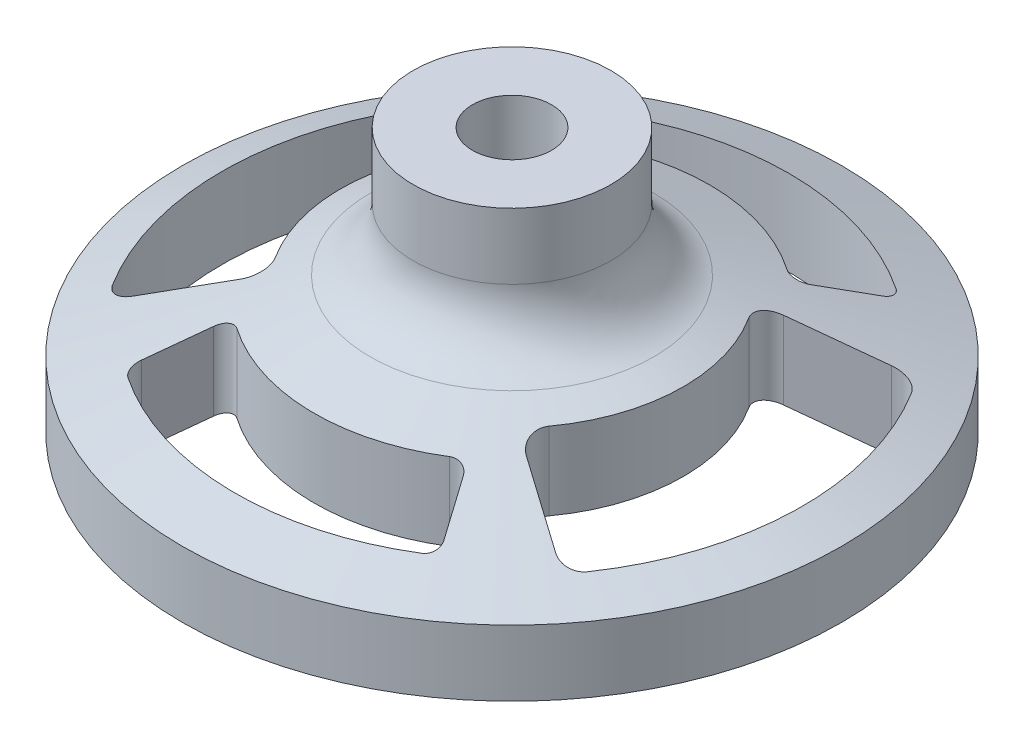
from build123d import *

# Parameters (mm, degrees)
CUT_EXTRUDE1_DEPTH = 407.201920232
CIRPATTERN1_COUNT  = 2
CUT_EXTRUDE2_DEPTH = 407.201920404
CIRPATTERN2_COUNT  = 2


with BuildPart() as part:
    # Sketch1 → Revolve1 (revolve)
    with BuildSketch(Plane.XY, mode=Mode.PRIVATE) as revolve1_sk:
        with BuildLine():
            Line((30, 73.116194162), (30, 200))
            Line((30, 200), (75, 200))
            Line((75, 200), (75, 150))
            ThreePointArc((75, 150), (83.927840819, 121.48548194), (107.523109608, 103.15388701))
            Line((107.523109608, 103.15388701), (250, 50))
            Line((250, 50), (250, 0))
            Line((250, 0), (200, 0))
            Line((200, 0), (200, 9))
            ThreePointArc((200, 9), (199.821443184, 9.570290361), (199.349537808, 9.93692226))
            Line((199.349537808, 9.93692226), (30, 73.116194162))
        make_face()
    revolve(revolve1_sk.sketch.rotate(Axis((0, 0, 0), (0, 1, 0)), 90), axis=Axis((0, 0, 0), (0, 1, 0)))

    # Sketch2 → Cut-Extrude1 (cut, through all)
    with BuildSketch(Plane(origin=(0, 200, 0), x_dir=(1, 0, 0), z_dir=(0, 1, 0))):
        with BuildLine():
            Line((-119.437073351, -161.51875661), (-99.386666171, -126.790432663))
            ThreePointArc((-99.386666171, -126.790432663), (-92.929634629, -122.036161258), (-85.056011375, -123.553530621))
            ThreePointArc((-85.056011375, -123.553530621), (-3.230621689, -149.965206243), (79.656274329, -127.101840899))
            ThreePointArc((79.656274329, -127.101840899), (87.379486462, -125.870739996), (93.626946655, -130.575296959))
            Line((93.626946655, -130.575296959), (113.637451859, -165.234508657))
            ThreePointArc((113.637451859, -165.234508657), (114.67294656, -172.682458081), (110.226057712, -178.74623409))
            ThreePointArc((110.226057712, -178.74623409), (-3.616119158, -209.968863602), (-116.315660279, -174.84469444))
            ThreePointArc((-116.315660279, -174.84469444), (-120.513283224, -168.79938602), (-119.437073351, -161.51875661))
        make_face()
    cut_extrude1 = extrude(amount=-CUT_EXTRUDE1_DEPTH, mode=Mode.SUBTRACT)

    # CirPattern1: Cut-Extrude1 ×2 about axis
    cirpattern1_axis = Axis((0, 0, 0), (0, 1, 0))
    for i in range(1, CIRPATTERN1_COUNT):
        add(cut_extrude1.rotate(cirpattern1_axis, i * 360 / CIRPATTERN1_COUNT), mode=Mode.SUBTRACT)

    # Sketch3 → Cut-Extrude2 (cut, symmetric)
    with BuildSketch(Plane(origin=(0, 200, 0), x_dir=(1, 0, 0), z_dir=(0, 1, 0))):
        with BuildLine():
            Line((109.542182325, -98.583181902), (161.717904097, -128.706848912))
            ThreePointArc((161.717904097, -128.706848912), (172.545530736, -130.342708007), (181.599701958, -124.183526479))
            ThreePointArc((181.599701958, -124.183526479), (219.945413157, -4.900533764), (186.950530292, 115.971976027))
            ThreePointArc((186.950530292, 115.971976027), (177.856505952, 122.613283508), (166.703903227, 121.0551769))
            Line((166.703903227, 121.0551769), (114.705581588, 91.033931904))
            ThreePointArc((114.705581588, 91.033931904), (107.63348261, 81.60078733), (109.563624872, 69.97008007))
            ThreePointArc((109.563624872, 69.97008007), (129.935330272, -4.099993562), (104.93437036, -76.738373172))
            ThreePointArc((104.93437036, -76.738373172), (102.365142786, -88.688686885), (109.542182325, -98.583181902))
        make_face()
    cut_extrude2 = extrude(amount=CUT_EXTRUDE2_DEPTH, both=True, mode=Mode.SUBTRACT)

    # CirPattern2: Cut-Extrude2 ×2 about axis
    cirpattern2_axis = Axis((0, 0, 0), (0, 1, 0))
    for i in range(1, CIRPATTERN2_COUNT):
        add(cut_extrude2.rotate(cirpattern2_axis, i * 360 / CIRPATTERN2_COUNT), mode=Mode.SUBTRACT)


solid = part.part
